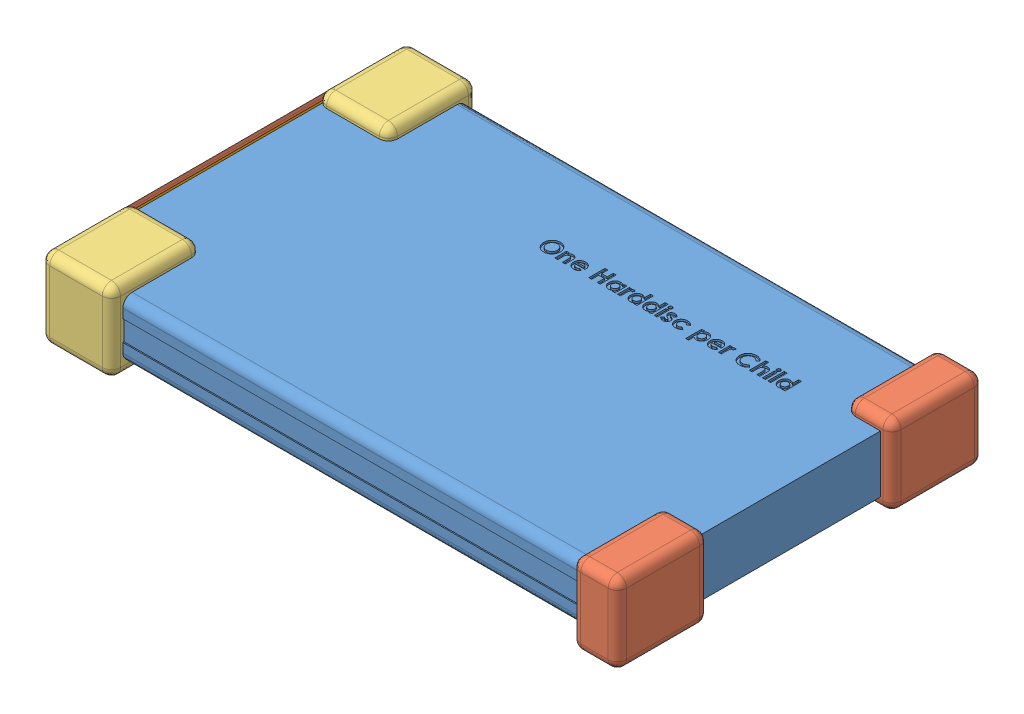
SolidWorks assembly Hard Drive II.SLDASM, configuration Default (file format 3800). Lengths in mm.
Overall size (167.76 17.5 80).
14 component instances, 12 part files, 27 mates.
Components (placement in the parent):
- 3DSolidWorks-Hard Drive Housing With Rubber Corners-1: 3DSolidWorks-Hard Drive Housing With Rubber Corners.SLDASM [Default] at (32.3827 -22.4174 -1.8578) size (126 17.5 80)
  - 3DSolidWorks-Hard Drive Housing-1: 3DSolidWorks-Hard Drive Housing.SLDPRT [Default] at (-95.613 24.3398 -1.0828) size (123 12.5 75)
  - 3DSolidWorks-Hard Drive Rubber Corners-1: 3DSolidWorks-Hard Drive Rubber Corners.SLDPRT [Default] at (27.387 24.3398 -1.0828) x (0 0 -1) z (1 0 0) size (80 17.5 10)
  - 3DSolidWorks-Hard Drive Rubber Corners - front-1: 3DSolidWorks-Hard Drive Rubber Corners - front.SLDPRT [Default] at (-95.613 24.3398 -1.0828) x (0 0 1) z (-1 0 0) size (80 17.5 15.5)
- 3DSolidWorks-Hard Drive Assembly-1: 3DSolidWorks-Hard Drive Assembly.SLDPRT [Default] at (-40.7303 17.0301 51.7693) x (0 0 -1) z (1 0 0) size (71 9 99)
- 3DSolidWorks-Hard Drive Gel Cushion-1: 3DSolidWorks-Hard Drive Gel Cushion.SLDPRT [Default] at (-40.7303 17.0301 51.7693) x (0 0 1) z (-1 0 0) size (73 10.51 10)
- 3DSolidWorks-Hard Drive Gel Cushion - front-1: 3DSolidWorks-Hard Drive Gel Cushion - front.SLDPRT [Default] at (-5.4926 17.0301 -57.6506) x (0 0 -1) z (1 0 0) size (73 10.51 87.38)
- 3DSolidWorks-Hard Drive Plate-1: 3DSolidWorks-Hard Drive Plate.SLDPRT [Default] at (-63.2303 9.4324 -2.8407) x (0 0 -1) z (1 0 0) size (66.8 4.23 24.5)
- 3DSolidWorks-Hard Drive LED-1: 3DSolidWorks-Hard Drive LED.SLDPRT [Default] at (-63.2303 0 0) x (0 0 -1) z (1 0 0) size (3 3 6.7)
- 3DSolidWorks-Hard Drive Seal-1: 3DSolidWorks-Hard Drive Seal.SLDPRT [Default] at (-63.2303 9.4224 -2.9407) x (0 0 -1) z (1 0 0) size (75 12.5 0.5)
- 3DSolidWorks-Hard Drive Seal 2-1: 3DSolidWorks-Hard Drive Seal 2.SLDPRT [Default] at (-63.2303 9.4224 -2.9407) x (0 0 -1) z (1 0 0) size (18 6.46 0.5)
- 3DSolidWorks-Hard Drive Cover-1: 3DSolidWorks-Hard Drive Cover.SLDPRT [Default] at (-63.2303 9.4224 -2.9407) x (0 0 1) z (-1 0 0) size (75 12.5 13)
- 3DSolidWorks-Hard Drive Screw-1: 3DSolidWorks-Hard Drive Screw.SLDPRT [Default] at (-58.2303 5.6724 -38.6907) x (0 0 -1) z (1 0 0) size (2.28 4.03 4)
- 3DSolidWorks-Hard Drive Screw-2: 3DSolidWorks-Hard Drive Screw.SLDPRT [Default] at (-58.2303 5.6724 32.8093) x (0 0 1) z (-1 0 0) size (2.28 4.03 4)
Mates (geometry in assembly coordinates):
- Deckungsgleich8: coincident anti-aligned: circle of 3DSolidWorks-Hard Drive Housing With Rubber Corners-1/3DSolidWorks-Hard Drive Housing-1; cylinder of 3DSolidWorks-Hard Drive Cover-1
- Deckungsgleich10: coincident aligned: plane of 3DSolidWorks-Hard Drive Housing With Rubber Corners-1/3DSolidWorks-Hard Drive Housing-1 through (59.7697 9.9224 -40.4407) normal (0 0 -1); plane of 3DSolidWorks-Hard Drive Cover-1 through (-66.2303 11.9224 -40.4407) normal (0 0 -1)
- Deckungsgleich11: coincident anti-aligned: plane of 3DSolidWorks-Hard Drive Cover-1 through (-63.2303 -0.5776 -40.4407) normal (1 0 0); plane of 3DSolidWorks-Hard Drive Plate-1 through (-63.2303 1.6924 30.5593) normal (-1 0 0)
- Deckungsgleich12: coincident anti-aligned: plane of 3DSolidWorks-Hard Drive Cover-1 through (-130.2345 2.4224 30.5593) normal (0 0 -1); plane of 3DSolidWorks-Hard Drive Plate-1 through (-40.7303 2.4224 30.5593) normal (0 0 1)
- Deckungsgleich13: coincident anti-aligned: plane of 3DSolidWorks-Hard Drive Cover-1 through (-130.2345 2.4224 30.5593) normal (0 -1 0); plane of 3DSolidWorks-Hard Drive Plate-1 through (-40.7303 2.4224 30.5593) normal (0 1 0)
- Deckungsgleich15: coincident anti-aligned: plane of 3DSolidWorks-Hard Drive Plate-1 through (-40.7303 1.6924 30.5593) normal (1 0 0); plane of 3DSolidWorks-Hard Drive Assembly-1 through (-40.7303 0.4224 32.5593) normal (-1 0 0)
- Deckungsgleich16: coincident aligned: plane of 3DSolidWorks-Hard Drive Cover-1 through (-83.0499 18.7858 -38.4407) normal (0 0 -1); plane of 3DSolidWorks-Hard Drive Assembly-1 through (58.2697 9.4224 -38.4407) normal (0 0 -1)
- Deckungsgleich17: coincident aligned: plane of 3DSolidWorks-Hard Drive Cover-1 through (-63.2303 0.4224 -36.4407) normal (0 -1 0); plane of 3DSolidWorks-Hard Drive Assembly-1 through (58.2697 0.4224 32.5593) normal (0 -1 0)
- Konzentrisch2: concentric anti-aligned: cylinder of 3DSolidWorks-Hard Drive Housing With Rubber Corners-1/3DSolidWorks-Hard Drive Housing-1; cylinder of 3DSolidWorks-Hard Drive Screw-1
- Deckungsgleich18: coincident anti-aligned: plane of 3DSolidWorks-Hard Drive Housing With Rubber Corners-1/3DSolidWorks-Hard Drive Housing-1 through (69.7697 3.4224 -40.1907) normal (0 0 -1); plane of 3DSolidWorks-Hard Drive Screw-1 through (-58.2303 7.6724 -40.1907) normal (0 0 1)
- Deckungsgleich21: coincident anti-aligned: plane of 3DSolidWorks-Hard Drive Housing With Rubber Corners-1/3DSolidWorks-Hard Drive Housing-1 through (-73.2303 3.4224 34.3093) normal (0 0 1); plane of 3DSolidWorks-Hard Drive Screw-2 through (-58.2303 7.6724 34.3093) normal (0 0 -1)
- Konzentrisch4: concentric aligned: cylinder of 3DSolidWorks-Hard Drive Housing With Rubber Corners-1/3DSolidWorks-Hard Drive Housing-1; cylinder of 3DSolidWorks-Hard Drive Screw-2
- Platziert1: in place: moOrthogonalPlaneRef_w of 3DSolidWorks-Hard Drive Assembly-1; unknown of 3DSolidWorks-Hard Drive Gel Cushion-1
- Deckungsgleich22: coincident aligned: plane of ?; plane of ?
- Deckungsgleich23: coincident aligned: moOrthogonalPlaneRef_w of ?; plane of ?
- Deckungsgleich24: coincident anti-aligned: moOrthogonalPlaneRef_w of ?; plane of ?
- Platziert2: in place: unknown of 3DSolidWorks-Hard Drive Cover-1; unknown of ?
- Deckungsgleich25: coincident aligned: plane of ?; plane of ?
- Deckungsgleich26: coincident aligned: moOrthogonalPlaneRef_w of ?; plane of ?
- Deckungsgleich27: coincident anti-aligned: moOrthogonalPlaneRef_w of ?; plane of ?
- Platziert3: in place: unknown of 3DSolidWorks-Hard Drive Cover-1; unknown of ?
- Deckungsgleich22: coincident aligned: plane of ?; plane of ?
- Deckungsgleich23: coincident aligned: moOrthogonalPlaneRef_w of ?; plane of ?
- Deckungsgleich24: coincident anti-aligned: moOrthogonalPlaneRef_w of ?; plane of ?
- Deckungsgleich22: coincident anti-aligned: plane of 3DSolidWorks-Hard Drive Assembly-1 through (58.2697 9.4224 32.5593) normal (0 1 0); plane of 3DSolidWorks-Hard Drive Gel Cushion - front-1 through (-171.5094 9.4224 30.5593) normal (0 -1 0)
- Deckungsgleich23: coincident anti-aligned: plane of 3DSolidWorks-Hard Drive Assembly-1 through (58.2697 9.4224 32.5593) normal (0 0 1); plane of 3DSolidWorks-Hard Drive Gel Cushion - front-1 through (-18.1115 -86.9738 32.5593) normal (0 0 -1)
- Deckungsgleich24: coincident: plane of 3DSolidWorks-Hard Drive Assembly-1 through (-28.1115 6.4224 -38.4407) normal (-1 0 0); line of 3DSolidWorks-Hard Drive Gel Cushion - front-1
